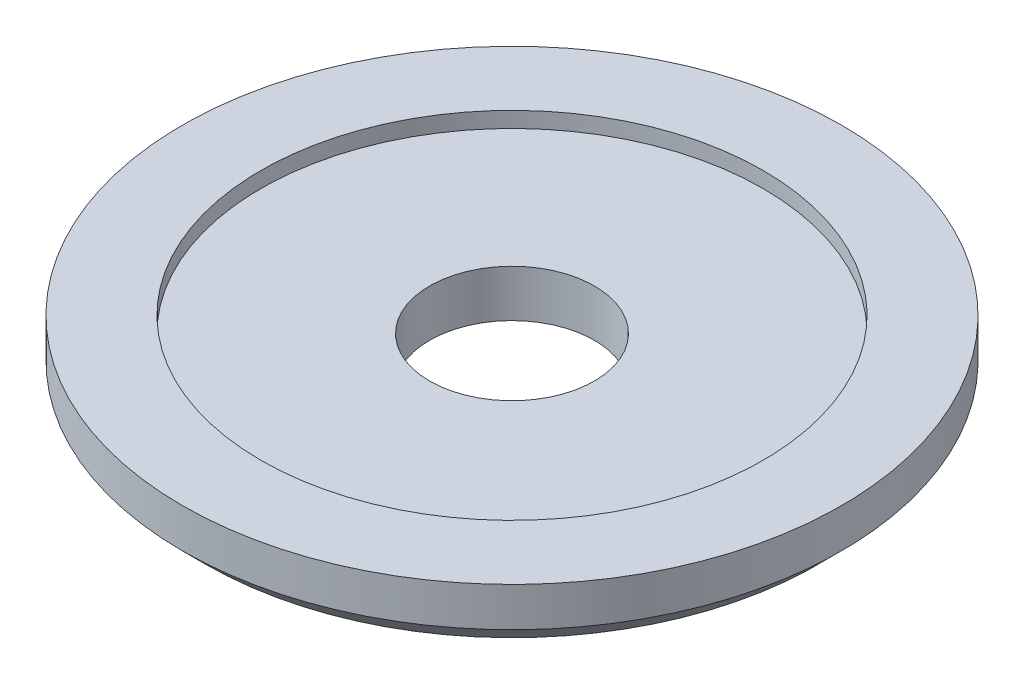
ISO-10303-21;
HEADER;
FILE_DESCRIPTION(('STEP AP214'),'2;1');
FILE_NAME('part.step','',(''),(''),'','','');
FILE_SCHEMA(('AUTOMOTIVE_DESIGN { 1 0 10303 214 1 1 1 1 }'));
ENDSEC;
DATA;
#1=APPLICATION_CONTEXT('core data for automotive mechanical design processes');
#2=APPLICATION_PROTOCOL_DEFINITION('international standard','automotive_design',2000,#1);
#3=PRODUCT_CONTEXT('',#1,'mechanical');
#4=PRODUCT('Part','Part','',(#3));
#5=PRODUCT_RELATED_PRODUCT_CATEGORY('part','',(#4));
#6=PRODUCT_DEFINITION_FORMATION('','',#4);
#7=PRODUCT_DEFINITION_CONTEXT('part definition',#1,'design');
#8=PRODUCT_DEFINITION('design','',#6,#7);
#9=PRODUCT_DEFINITION_SHAPE('','',#8);
#10=(LENGTH_UNIT() NAMED_UNIT(*) SI_UNIT(.MILLI.,.METRE.));
#11=(NAMED_UNIT(*) PLANE_ANGLE_UNIT() SI_UNIT($,.RADIAN.));
#12=(NAMED_UNIT(*) SI_UNIT($,.STERADIAN.) SOLID_ANGLE_UNIT());
#13=UNCERTAINTY_MEASURE_WITH_UNIT(LENGTH_MEASURE(1.E-05),#10,'distance_accuracy_value','');
#14=(GEOMETRIC_REPRESENTATION_CONTEXT(3) GLOBAL_UNCERTAINTY_ASSIGNED_CONTEXT((#13)) GLOBAL_UNIT_ASSIGNED_CONTEXT((#10,
#11,#12)) REPRESENTATION_CONTEXT('',''));
#15=CARTESIAN_POINT('',(0.,0.,0.));
#16=DIRECTION('',(0.,0.,1.));
#17=DIRECTION('',(1.,0.,0.));
#18=AXIS2_PLACEMENT_3D('',#15,#16,#17);
#19=CARTESIAN_POINT('',(0.,3.,0.));
#20=DIRECTION('',(0.,1.,0.));
#21=DIRECTION('',(0.,0.,1.));
#22=AXIS2_PLACEMENT_3D('',#19,#20,#21);
#23=PLANE('',#22);
#24=CARTESIAN_POINT('',(0.,3.,0.));
#25=DIRECTION('',(0.,1.,0.));
#26=DIRECTION('',(0.,0.,1.));
#27=AXIS2_PLACEMENT_3D('',#24,#25,#26);
#28=CIRCLE('',#27,16.);
#29=CARTESIAN_POINT('',(0.,3.,16.));
#30=VERTEX_POINT('',#29);
#31=EDGE_CURVE('E49',#30,#30,#28,.F.);
#32=ORIENTED_EDGE('',*,*,#31,.F.);
#33=EDGE_LOOP('',(#32));
#34=FACE_BOUND('',#33,.T.);
#35=CARTESIAN_POINT('',(0.,3.,0.));
#36=DIRECTION('',(0.,1.,0.));
#37=DIRECTION('',(0.,0.,1.));
#38=AXIS2_PLACEMENT_3D('',#35,#36,#37);
#39=CIRCLE('',#38,5.25);
#40=CARTESIAN_POINT('',(0.,3.,5.25));
#41=VERTEX_POINT('',#40);
#42=EDGE_CURVE('E55',#41,#41,#39,.T.);
#43=ORIENTED_EDGE('',*,*,#42,.F.);
#44=EDGE_LOOP('',(#43));
#45=FACE_BOUND('',#44,.T.);
#46=ADVANCED_FACE('F34',(#34,#45),#23,.T.);
#47=CARTESIAN_POINT('',(0.,0.,0.));
#48=DIRECTION('',(0.,1.,0.));
#49=DIRECTION('',(0.,0.,1.));
#50=AXIS2_PLACEMENT_3D('',#47,#48,#49);
#51=PLANE('',#50);
#52=CARTESIAN_POINT('',(0.,0.,0.));
#53=DIRECTION('',(0.,1.,0.));
#54=DIRECTION('',(0.,0.,1.));
#55=AXIS2_PLACEMENT_3D('',#52,#53,#54);
#56=CIRCLE('',#55,19.5);
#57=CARTESIAN_POINT('',(0.,0.,19.5));
#58=VERTEX_POINT('',#57);
#59=EDGE_CURVE('E10',#58,#58,#56,.F.);
#60=ORIENTED_EDGE('',*,*,#59,.T.);
#61=EDGE_LOOP('',(#60));
#62=FACE_BOUND('',#61,.T.);
#63=CARTESIAN_POINT('',(0.,0.,0.));
#64=DIRECTION('',(0.,1.,0.));
#65=DIRECTION('',(0.,0.,1.));
#66=AXIS2_PLACEMENT_3D('',#63,#64,#65);
#67=CIRCLE('',#66,5.25);
#68=CARTESIAN_POINT('',(0.,0.,5.25));
#69=VERTEX_POINT('',#68);
#70=EDGE_CURVE('E58',#69,#69,#67,.T.);
#71=ORIENTED_EDGE('',*,*,#70,.T.);
#72=EDGE_LOOP('',(#71));
#73=FACE_BOUND('',#72,.T.);
#74=ADVANCED_FACE('F88',(#62,#73),#51,.F.);
#75=CARTESIAN_POINT('',(0.,3.,0.));
#76=DIRECTION('',(0.,-1.,0.));
#77=DIRECTION('',(0.,0.,-1.));
#78=AXIS2_PLACEMENT_3D('',#75,#76,#77);
#79=CYLINDRICAL_SURFACE('',#78,21.);
#80=CARTESIAN_POINT('',(0.,1.5,0.));
#81=DIRECTION('',(0.,1.,0.));
#82=DIRECTION('',(0.,0.,1.));
#83=AXIS2_PLACEMENT_3D('',#80,#81,#82);
#84=CIRCLE('',#83,21.);
#85=CARTESIAN_POINT('',(0.,1.5,21.));
#86=VERTEX_POINT('',#85);
#87=EDGE_CURVE('E42',#86,#86,#84,.T.);
#88=ORIENTED_EDGE('',*,*,#87,.T.);
#89=EDGE_LOOP('',(#88));
#90=FACE_BOUND('',#89,.T.);
#91=CARTESIAN_POINT('',(0.,4.,0.));
#92=DIRECTION('',(0.,1.,0.));
#93=DIRECTION('',(0.,0.,1.));
#94=AXIS2_PLACEMENT_3D('',#91,#92,#93);
#95=CIRCLE('',#94,21.);
#96=CARTESIAN_POINT('',(0.,4.,21.));
#97=VERTEX_POINT('',#96);
#98=EDGE_CURVE('E61',#97,#97,#95,.T.);
#99=ORIENTED_EDGE('',*,*,#98,.F.);
#100=EDGE_LOOP('',(#99));
#101=FACE_BOUND('',#100,.T.);
#102=ADVANCED_FACE('F84',(#90,#101),#79,.T.);
#103=CARTESIAN_POINT('',(0.,3.,0.));
#104=DIRECTION('',(0.,-1.,0.));
#105=DIRECTION('',(0.,0.,-1.));
#106=AXIS2_PLACEMENT_3D('',#103,#104,#105);
#107=CYLINDRICAL_SURFACE('',#106,5.25);
#108=ORIENTED_EDGE('',*,*,#42,.T.);
#109=EDGE_LOOP('',(#108));
#110=FACE_BOUND('',#109,.T.);
#111=ORIENTED_EDGE('',*,*,#70,.F.);
#112=EDGE_LOOP('',(#111));
#113=FACE_BOUND('',#112,.T.);
#114=ADVANCED_FACE('F76',(#110,#113),#107,.F.);
#115=CARTESIAN_POINT('',(0.,4.,0.));
#116=DIRECTION('',(0.,1.,0.));
#117=DIRECTION('',(0.,0.,1.));
#118=AXIS2_PLACEMENT_3D('',#115,#116,#117);
#119=PLANE('',#118);
#120=ORIENTED_EDGE('',*,*,#98,.T.);
#121=EDGE_LOOP('',(#120));
#122=FACE_BOUND('',#121,.T.);
#123=CARTESIAN_POINT('',(0.,4.,0.));
#124=DIRECTION('',(0.,1.,0.));
#125=DIRECTION('',(0.,0.,1.));
#126=AXIS2_PLACEMENT_3D('',#123,#124,#125);
#127=CIRCLE('',#126,16.);
#128=CARTESIAN_POINT('',(0.,4.,16.));
#129=VERTEX_POINT('',#128);
#130=EDGE_CURVE('E67',#129,#129,#127,.T.);
#131=ORIENTED_EDGE('',*,*,#130,.F.);
#132=EDGE_LOOP('',(#131));
#133=FACE_BOUND('',#132,.T.);
#134=ADVANCED_FACE('F74',(#122,#133),#119,.T.);
#135=CARTESIAN_POINT('',(0.,4.,0.));
#136=DIRECTION('',(0.,-1.,0.));
#137=DIRECTION('',(0.,0.,-1.));
#138=AXIS2_PLACEMENT_3D('',#135,#136,#137);
#139=CYLINDRICAL_SURFACE('',#138,16.);
#140=ORIENTED_EDGE('',*,*,#130,.T.);
#141=EDGE_LOOP('',(#140));
#142=FACE_BOUND('',#141,.T.);
#143=ORIENTED_EDGE('',*,*,#31,.T.);
#144=EDGE_LOOP('',(#143));
#145=FACE_BOUND('',#144,.T.);
#146=ADVANCED_FACE('F71',(#142,#145),#139,.F.);
#147=CARTESIAN_POINT('',(0.,1.5,0.));
#148=DIRECTION('',(0.,1.,0.));
#149=DIRECTION('',(0.,0.,1.));
#150=AXIS2_PLACEMENT_3D('',#147,#148,#149);
#151=CONICAL_SURFACE('',#150,21.,0.785398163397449);
#152=ORIENTED_EDGE('',*,*,#59,.F.);
#153=EDGE_LOOP('',(#152));
#154=FACE_BOUND('',#153,.T.);
#155=ORIENTED_EDGE('',*,*,#87,.F.);
#156=EDGE_LOOP('',(#155));
#157=FACE_BOUND('',#156,.T.);
#158=ADVANCED_FACE('F36',(#154,#157),#151,.T.);
#159=CLOSED_SHELL('',(#46,#74,#102,#114,#134,#146,#158));
#160=MANIFOLD_SOLID_BREP('B2',#159);
#161=ADVANCED_BREP_SHAPE_REPRESENTATION('',(#18,#160),#14);
#162=SHAPE_DEFINITION_REPRESENTATION(#9,#161);
ENDSEC;
END-ISO-10303-21;
